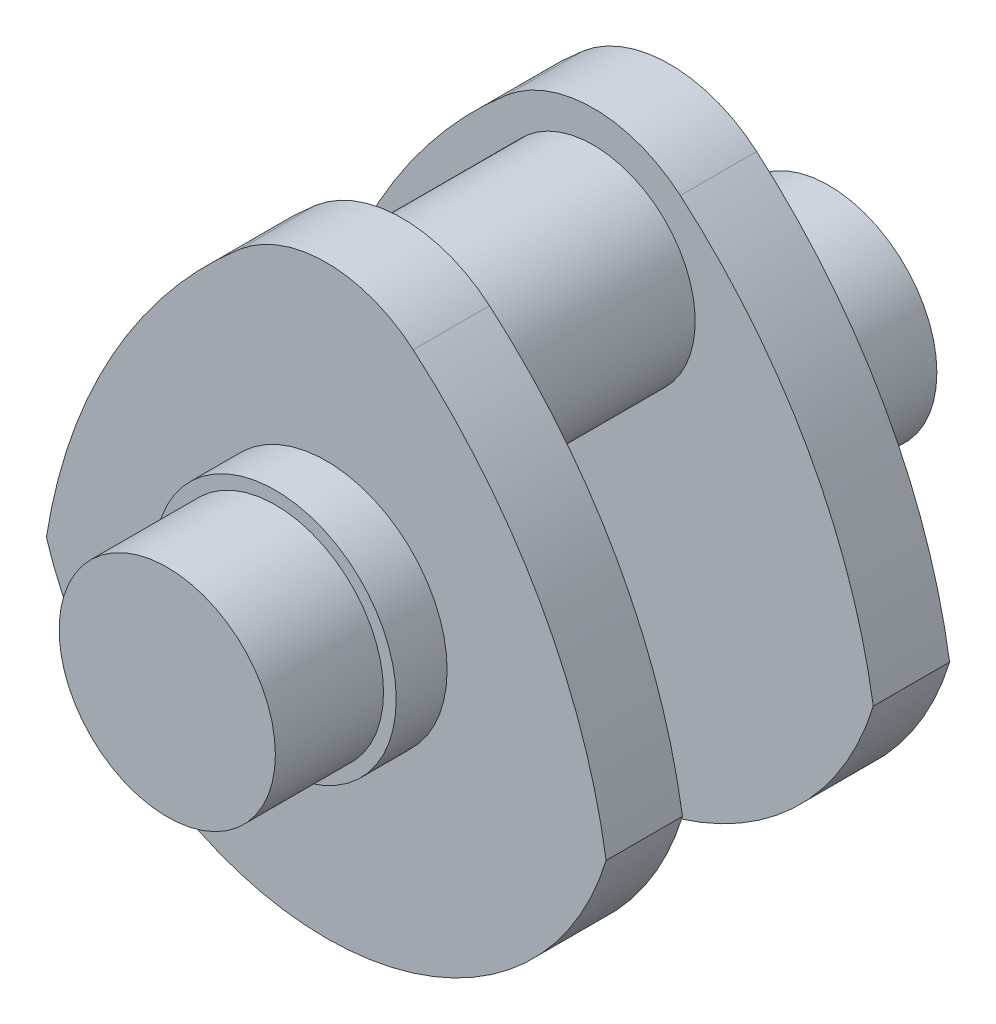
from build123d import *

# Parameters (mm, degrees)
SKETCH1_R           = 17
BOSS_EXTRUDE1_DEPTH = 25
SKETCH2_R           = 19
BOSS_EXTRUDE3_DEPTH = 8
BOSS_EXTRUDE4_DEPTH = 12
SKETCH4_R           = 16
BOSS_EXTRUDE5_DEPTH = 15


with BuildPart() as part:
    # Sketch1 → Boss-Extrude1 (new body)
    with BuildSketch(Plane.XY):
        Circle(SKETCH1_R)
    extrude(amount=BOSS_EXTRUDE1_DEPTH)

    # Sketch2 → Boss-Extrude3 (add)
    with BuildSketch(Plane.XY):
        Circle(SKETCH2_R)
    extrude(amount=BOSS_EXTRUDE3_DEPTH)

    # Sketch3 → Boss-Extrude4 (add)
    with BuildSketch(Plane(origin=(0, 0, 0), x_dir=(-1, 0, 0), z_dir=(0, 0, -1))):
        with BuildLine():
            ThreePointArc((-44, -13.416407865), (0, -46), (44, -13.416407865))
            ThreePointArc((44, -13.416407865), (33.683444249, 16.469257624), (13.668094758, 40.943123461))
            ThreePointArc((13.668094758, 40.943123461), (0, 46), (-13.668094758, 40.943123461))
            ThreePointArc((-13.668094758, 40.943123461), (-33.683444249, 16.469257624), (-44, -13.416407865))
        make_face()
    extrude(amount=BOSS_EXTRUDE4_DEPTH)

    # Sketch4 → Boss-Extrude5 (add)
    with BuildSketch(Plane(origin=(0, 0, -12), x_dir=(-1, 0, 0), z_dir=(0, 0, -1))):
        with Locations((0, 25)):
            Circle(SKETCH4_R)
    extrude(amount=BOSS_EXTRUDE5_DEPTH)

    # Mirror1: part across plane


with BuildPart() as part_1:
    add(part.part)
    add(part.part.mirror(Plane(origin=(0, 25, -27), x_dir=(1, 0, 0), z_dir=(0, 0, -1))))


solid = part_1.part
